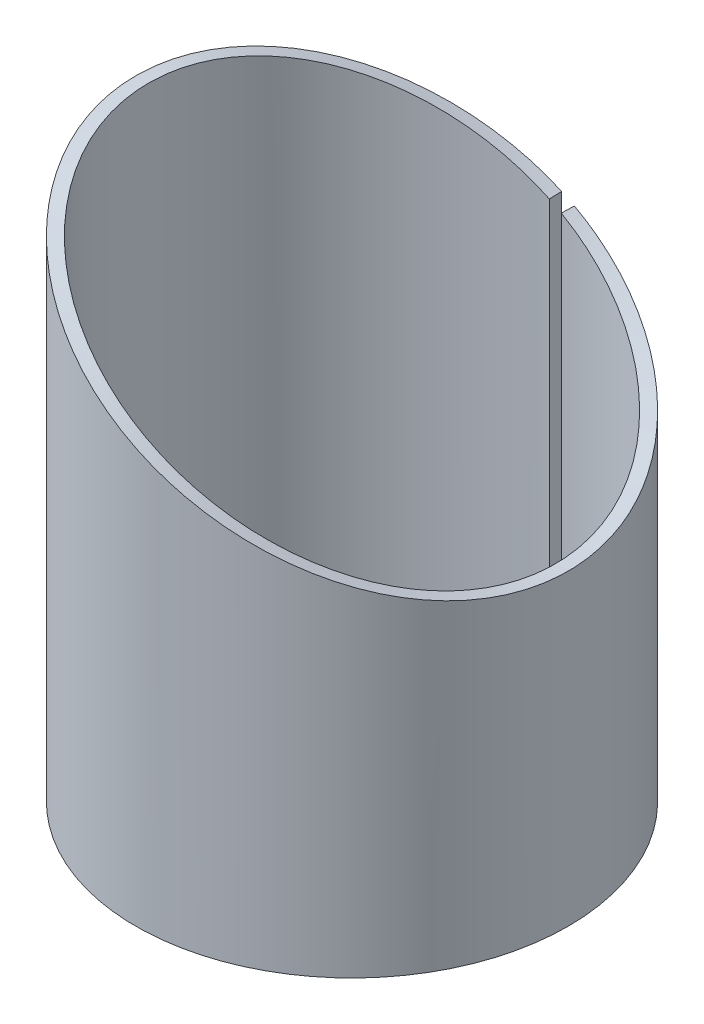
ISO-10303-21;
HEADER;
FILE_DESCRIPTION(('STEP AP214'),'2;1');
FILE_NAME('part.step','',(''),(''),'','','');
FILE_SCHEMA(('AUTOMOTIVE_DESIGN { 1 0 10303 214 1 1 1 1 }'));
ENDSEC;
DATA;
#1=APPLICATION_CONTEXT('core data for automotive mechanical design processes');
#2=APPLICATION_PROTOCOL_DEFINITION('international standard','automotive_design',2000,#1);
#3=PRODUCT_CONTEXT('',#1,'mechanical');
#4=PRODUCT('Part','Part','',(#3));
#5=PRODUCT_RELATED_PRODUCT_CATEGORY('part','',(#4));
#6=PRODUCT_DEFINITION_FORMATION('','',#4);
#7=PRODUCT_DEFINITION_CONTEXT('part definition',#1,'design');
#8=PRODUCT_DEFINITION('design','',#6,#7);
#9=PRODUCT_DEFINITION_SHAPE('','',#8);
#10=(LENGTH_UNIT() NAMED_UNIT(*) SI_UNIT(.MILLI.,.METRE.));
#11=(NAMED_UNIT(*) PLANE_ANGLE_UNIT() SI_UNIT($,.RADIAN.));
#12=(NAMED_UNIT(*) SI_UNIT($,.STERADIAN.) SOLID_ANGLE_UNIT());
#13=UNCERTAINTY_MEASURE_WITH_UNIT(LENGTH_MEASURE(1.E-05),#10,'distance_accuracy_value','');
#14=(GEOMETRIC_REPRESENTATION_CONTEXT(3) GLOBAL_UNCERTAINTY_ASSIGNED_CONTEXT((#13)) GLOBAL_UNIT_ASSIGNED_CONTEXT((#10,
#11,#12)) REPRESENTATION_CONTEXT('',''));
#15=CARTESIAN_POINT('',(0.,0.,0.));
#16=DIRECTION('',(0.,0.,1.));
#17=DIRECTION('',(1.,0.,0.));
#18=AXIS2_PLACEMENT_3D('',#15,#16,#17);
#19=CARTESIAN_POINT('',(-43.4377584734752,-32.7102460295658,-16.9698156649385));
#20=CARTESIAN_POINT('',(-44.0672901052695,-32.3998788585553,-16.9512670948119));
#21=CARTESIAN_POINT('',(-44.633374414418,-32.1211131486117,-16.8998626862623));
#22=CARTESIAN_POINT('',(-45.6364569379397,-31.6265191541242,-16.7689444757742));
#23=CARTESIAN_POINT('',(-46.0734881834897,-31.4107351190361,-16.6894479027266));
#24=CARTESIAN_POINT('',(-46.5405221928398,-31.1803962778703,-16.5907760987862));
#25=CARTESIAN_POINT('',(-46.630176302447,-31.1361994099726,-16.5710348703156));
#26=CARTESIAN_POINT('',(-46.8099582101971,-31.0475701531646,-16.5299490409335));
#27=CARTESIAN_POINT('',(-46.8990439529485,-31.0036563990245,-16.5088195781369));
#28=CARTESIAN_POINT('',(-47.1638725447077,-30.8731177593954,-16.4437725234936));
#29=CARTESIAN_POINT('',(-47.3371858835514,-30.7876954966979,-16.3981967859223));
#30=CARTESIAN_POINT('',(-47.847337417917,-30.5362391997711,-16.2556261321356));
#31=CARTESIAN_POINT('',(-48.1743750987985,-30.3750156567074,-16.1527968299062));
#32=CARTESIAN_POINT('',(-48.8022584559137,-30.0653965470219,-15.9355777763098));
#33=CARTESIAN_POINT('',(-49.1031066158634,-29.9170009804,-15.8211886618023));
#34=CARTESIAN_POINT('',(-49.534956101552,-29.7040286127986,-15.6437159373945));
#35=CARTESIAN_POINT('',(-49.6757224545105,-29.6346194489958,-15.5835716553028));
#36=CARTESIAN_POINT('',(-49.9543621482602,-29.4972382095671,-15.4601143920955));
#37=CARTESIAN_POINT('',(-50.0917868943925,-29.4294869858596,-15.3969814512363));
#38=CARTESIAN_POINT('',(-50.7693843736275,-29.0954278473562,-15.0748315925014));
#39=CARTESIAN_POINT('',(-51.2808979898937,-28.8432108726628,-14.7964060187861));
#40=CARTESIAN_POINT('',(-52.2428444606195,-28.3688375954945,-14.2111569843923));
#41=CARTESIAN_POINT('',(-52.6925885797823,-28.1471378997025,-13.9051960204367));
#42=CARTESIAN_POINT('',(-53.5492137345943,-27.7248095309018,-13.2630390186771));
#43=CARTESIAN_POINT('',(-53.953853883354,-27.5252609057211,-12.9280575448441));
#44=CARTESIAN_POINT('',(-54.7160446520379,-27.149394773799,-12.2376878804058));
#45=CARTESIAN_POINT('',(-55.0730253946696,-26.9734407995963,-11.8830805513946));
#46=CARTESIAN_POINT('',(-55.7482552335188,-26.6405727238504,-11.1518374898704));
#47=CARTESIAN_POINT('',(-56.0655616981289,-26.4841101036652,-10.775940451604));
#48=CARTESIAN_POINT('',(-56.6596315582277,-26.1911276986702,-10.0085118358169));
#49=CARTESIAN_POINT('',(-56.9359494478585,-26.0548577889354,-9.61770165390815));
#50=CARTESIAN_POINT('',(-57.4510101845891,-25.8009430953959,-8.82128451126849));
#51=CARTESIAN_POINT('',(-57.6899239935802,-25.6831687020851,-8.41525419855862));
#52=CARTESIAN_POINT('',(-58.130382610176,-25.4659858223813,-7.59124908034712));
#53=CARTESIAN_POINT('',(-58.3319284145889,-25.3665773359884,-7.17327521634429));
#54=CARTESIAN_POINT('',(-58.697861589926,-25.1861262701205,-6.3289410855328));
#55=CARTESIAN_POINT('',(-58.8626760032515,-25.1049395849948,-5.90173373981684));
#56=CARTESIAN_POINT('',(-59.5987210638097,-24.7426429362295,-3.73871923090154));
#57=CARTESIAN_POINT('',(-59.8995106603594,-24.5939306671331,-1.93128972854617));
#58=CARTESIAN_POINT('',(-59.9180662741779,-24.5844466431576,0.306892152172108));
#59=CARTESIAN_POINT('',(-59.9041415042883,-24.5913710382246,0.753608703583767));
#60=CARTESIAN_POINT('',(-59.84062541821,-24.622923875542,1.64899007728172));
#61=CARTESIAN_POINT('',(-59.7910066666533,-24.6475444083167,2.09680711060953));
#62=CARTESIAN_POINT('',(-59.5880540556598,-24.7479383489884,3.43628066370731));
#63=CARTESIAN_POINT('',(-59.3804979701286,-24.8502440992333,4.32398357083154));
#64=CARTESIAN_POINT('',(-58.9609022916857,-25.0567674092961,5.62960691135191));
#65=CARTESIAN_POINT('',(-58.8030244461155,-25.1344526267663,6.06048587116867));
#66=CARTESIAN_POINT('',(-58.451647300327,-25.3075112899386,6.91052869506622));
#67=CARTESIAN_POINT('',(-58.2584153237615,-25.4028037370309,7.32931916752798));
#68=CARTESIAN_POINT('',(-57.8336552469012,-25.6122911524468,8.15804542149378));
#69=CARTESIAN_POINT('',(-57.6023898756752,-25.726345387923,8.56723652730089));
#70=CARTESIAN_POINT('',(-57.10194961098,-25.9730749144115,9.37148042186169));
#71=CARTESIAN_POINT('',(-56.8331905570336,-26.1055297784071,9.76598331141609));
#72=CARTESIAN_POINT('',(-55.9675313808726,-26.53235198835,10.9261584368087));
#73=CARTESIAN_POINT('',(-55.307654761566,-26.8578174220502,11.6726474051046));
#74=CARTESIAN_POINT('',(-54.1927585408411,-27.4073915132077,12.7204447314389));
#75=CARTESIAN_POINT('',(-53.7978107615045,-27.6021935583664,13.0601646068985));
#76=CARTESIAN_POINT('',(-52.9573285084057,-28.0166654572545,13.7155696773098));
#77=CARTESIAN_POINT('',(-52.5122757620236,-28.236072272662,14.030789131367));
#78=CARTESIAN_POINT('',(-51.8076190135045,-28.583438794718,14.4785242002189));
#79=CARTESIAN_POINT('',(-51.5658943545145,-28.7026259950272,14.6240554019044));
#80=CARTESIAN_POINT('',(-51.0644902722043,-28.9498919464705,14.9085195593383));
#81=CARTESIAN_POINT('',(-50.8053993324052,-29.0776647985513,15.047072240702));
#82=CARTESIAN_POINT('',(-50.2703354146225,-29.3414902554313,15.3149427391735));
#83=CARTESIAN_POINT('',(-49.9943617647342,-29.4775428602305,15.4442602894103));
#84=CARTESIAN_POINT('',(-49.5677772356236,-29.687831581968,15.6298285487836));
#85=CARTESIAN_POINT('',(-49.4234796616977,-29.758962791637,15.6902825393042));
#86=CARTESIAN_POINT('',(-49.1307016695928,-29.9032951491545,15.8081308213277));
#87=CARTESIAN_POINT('',(-48.9827061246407,-29.9762565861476,15.865361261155));
#88=CARTESIAN_POINT('',(-48.2202809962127,-30.3522462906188,16.1475255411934));
#89=CARTESIAN_POINT('',(-47.5457361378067,-30.6849708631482,16.3575197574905));
#90=CARTESIAN_POINT('',(-46.6209904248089,-31.1407925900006,16.5739109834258));
#91=CARTESIAN_POINT('',(-46.4319840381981,-31.2339527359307,16.614865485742));
#92=CARTESIAN_POINT('',(-46.1906998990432,-31.3528976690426,16.6626959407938));
#93=CARTESIAN_POINT('',(-46.1421918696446,-31.3768113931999,16.6720938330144));
#94=CARTESIAN_POINT('',(-46.0446749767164,-31.4248883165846,16.6905415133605));
#95=CARTESIAN_POINT('',(-45.9957861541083,-31.4489922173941,16.6995754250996));
#96=CARTESIAN_POINT('',(-45.8421112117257,-31.5247933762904,16.7272297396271));
#97=CARTESIAN_POINT('',(-45.7323729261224,-31.578953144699,16.746009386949));
#98=CARTESIAN_POINT('',(-45.1469887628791,-31.8678802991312,16.8395027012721));
#99=CARTESIAN_POINT('',(-44.5608347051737,-32.1570326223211,16.9141436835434));
#100=CARTESIAN_POINT('',(-43.6800219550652,-32.5909862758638,16.9618634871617));
#101=CARTESIAN_POINT('',(-43.4964851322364,-32.6814026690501,16.9690573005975));
#102=CARTESIAN_POINT('',(-43.2102234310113,-32.8224657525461,16.9752618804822));
#103=CARTESIAN_POINT('',(-43.1129774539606,-32.8703931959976,16.9765648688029));
#104=CARTESIAN_POINT('',(-42.9148609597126,-32.9680609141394,16.9774536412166));
#105=CARTESIAN_POINT('',(-42.8146225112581,-33.0174845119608,16.9770123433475));
#106=CARTESIAN_POINT('',(-42.3281743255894,-33.2572381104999,16.9706959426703));
#107=CARTESIAN_POINT('',(-41.9680632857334,-33.4345926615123,16.9527066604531));
#108=CARTESIAN_POINT('',(-40.9763223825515,-33.9233113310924,16.8765258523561));
#109=CARTESIAN_POINT('',(-40.4335223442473,-34.1913304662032,16.7970400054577));
#110=CARTESIAN_POINT('',(-39.9009378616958,-34.454112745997,16.7037139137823));
#111=CARTESIAN_POINT('',(-39.8035372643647,-34.5021361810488,16.6856578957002));
#112=CARTESIAN_POINT('',(-39.6083928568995,-34.5983464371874,16.6478180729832));
#113=CARTESIAN_POINT('',(-39.511821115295,-34.6459532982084,16.6282031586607));
#114=CARTESIAN_POINT('',(-39.2251247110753,-34.787279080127,16.5674128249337));
#115=CARTESIAN_POINT('',(-39.0380201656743,-34.87950319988,16.5242926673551));
#116=CARTESIAN_POINT('',(-38.4888762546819,-35.1501963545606,16.3882379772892));
#117=CARTESIAN_POINT('',(-38.13902391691,-35.3226861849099,16.2886239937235));
#118=CARTESIAN_POINT('',(-37.4718277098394,-35.6517213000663,16.0770247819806));
#119=CARTESIAN_POINT('',(-37.154479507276,-35.8082665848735,15.9650404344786));
#120=CARTESIAN_POINT('',(-36.5518021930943,-36.1054126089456,15.7336707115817));
#121=CARTESIAN_POINT('',(-36.2600542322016,-36.2492170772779,15.6118431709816));
#122=CARTESIAN_POINT('',(-35.4090243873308,-36.6687530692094,15.2292401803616));
#123=CARTESIAN_POINT('',(-34.8761470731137,-36.9315489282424,14.9522068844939));
#124=CARTESIAN_POINT('',(-34.1281666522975,-37.3004005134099,14.5154776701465));
#125=CARTESIAN_POINT('',(-33.887996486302,-37.4187977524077,14.3667947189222));
#126=CARTESIAN_POINT('',(-33.419332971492,-37.6498303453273,14.0606741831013));
#127=CARTESIAN_POINT('',(-33.1912897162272,-37.7622491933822,13.9034535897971));
#128=CARTESIAN_POINT('',(-32.5260986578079,-38.0902133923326,13.4209578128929));
#129=CARTESIAN_POINT('',(-32.1079232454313,-38.2964663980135,13.0848703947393));
#130=CARTESIAN_POINT('',(-31.3216554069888,-38.6841928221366,12.3921472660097));
#131=CARTESIAN_POINT('',(-30.952942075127,-38.8659145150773,12.0352075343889));
#132=CARTESIAN_POINT('',(-30.2556496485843,-39.2096949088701,11.2980600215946));
#133=CARTESIAN_POINT('',(-29.9283077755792,-39.3711291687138,10.9189001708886));
#134=CARTESIAN_POINT('',(-29.3160168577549,-39.6730858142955,10.1447692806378));
#135=CARTESIAN_POINT('',(-29.0313706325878,-39.8134030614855,9.75038338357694));
#136=CARTESIAN_POINT('',(-28.4998807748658,-40.0754114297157,8.94456742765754));
#137=CARTESIAN_POINT('',(-28.2535618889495,-40.1968599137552,8.53371104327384));
#138=CARTESIAN_POINT('',(-27.7997787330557,-40.4206454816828,7.70009239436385));
#139=CARTESIAN_POINT('',(-27.5925511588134,-40.5228778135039,7.27788224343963));
#140=CARTESIAN_POINT('',(-27.2154838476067,-40.7087091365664,6.42285279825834));
#141=CARTESIAN_POINT('',(-27.045184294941,-40.7925271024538,5.98885591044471));
#142=CARTESIAN_POINT('',(-26.589738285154,-41.0166879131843,4.67220947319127));
#143=CARTESIAN_POINT('',(-26.3601769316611,-41.1297376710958,3.77493084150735));
#144=CARTESIAN_POINT('',(-26.0499172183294,-41.2830556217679,1.9665020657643));
#145=CARTESIAN_POINT('',(-25.969210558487,-41.3233146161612,1.05631896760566));
#146=CARTESIAN_POINT('',(-25.9532588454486,-41.3310892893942,-0.757760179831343));
#147=CARTESIAN_POINT('',(-26.0180940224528,-41.2986873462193,-1.67023779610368));
#148=CARTESIAN_POINT('',(-26.2962618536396,-41.1613049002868,-3.48214440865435));
#149=CARTESIAN_POINT('',(-26.5096047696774,-41.0563243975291,-4.38155187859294));
#150=CARTESIAN_POINT('',(-27.0836618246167,-40.7737848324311,-6.14246289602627));
#151=CARTESIAN_POINT('',(-27.4429202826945,-40.5965793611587,-7.00207337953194));
#152=CARTESIAN_POINT('',(-28.0980944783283,-40.2734939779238,-8.26030361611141));
#153=CARTESIAN_POINT('',(-28.3357153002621,-40.1563513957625,-8.67384333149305));
#154=CARTESIAN_POINT('',(-28.849333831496,-39.903171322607,-9.4853315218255));
#155=CARTESIAN_POINT('',(-29.1251348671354,-39.7671943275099,-9.88317831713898));
#156=CARTESIAN_POINT('',(-29.7194872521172,-39.4740727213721,-10.6650405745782));
#157=CARTESIAN_POINT('',(-30.0375721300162,-39.3172094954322,-11.0482523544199));
#158=CARTESIAN_POINT('',(-30.7157282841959,-38.9828781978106,-11.7940945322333));
#159=CARTESIAN_POINT('',(-31.0746945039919,-38.8059597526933,-12.155793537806));
#160=CARTESIAN_POINT('',(-31.8416965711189,-38.4277224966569,-12.8597439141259));
#161=CARTESIAN_POINT('',(-32.2495086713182,-38.2265943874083,-13.2015242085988));
#162=CARTESIAN_POINT('',(-32.8979646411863,-37.9068880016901,-13.6930914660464));
#163=CARTESIAN_POINT('',(-33.1202318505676,-37.7973168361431,-13.853425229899));
#164=CARTESIAN_POINT('',(-33.5769414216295,-37.5721697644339,-14.1660270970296));
#165=CARTESIAN_POINT('',(-33.8115590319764,-37.456494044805,-14.3184610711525));
#166=CARTESIAN_POINT('',(-34.540058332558,-37.0972735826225,-14.7657738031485));
#167=CARTESIAN_POINT('',(-35.0566424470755,-36.8425739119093,-15.0492904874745));
#168=CARTESIAN_POINT('',(-35.8778572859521,-36.4376953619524,-15.442621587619));
#169=CARTESIAN_POINT('',(-36.1582842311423,-36.2994283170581,-15.5679815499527));
#170=CARTESIAN_POINT('',(-36.7388361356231,-36.0130867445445,-15.8081207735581));
#171=CARTESIAN_POINT('',(-37.0420684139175,-35.8635081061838,-15.924121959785));
#172=CARTESIAN_POINT('',(-37.6747204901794,-35.5515351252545,-16.1442637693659));
#173=CARTESIAN_POINT('',(-38.0041427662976,-35.3891407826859,-16.24840373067));
#174=CARTESIAN_POINT('',(-38.517856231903,-35.1359374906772,-16.3927039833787));
#175=CARTESIAN_POINT('',(-38.6923543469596,-35.0499344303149,-16.438816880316));
#176=CARTESIAN_POINT('',(-38.9589540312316,-34.9185268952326,-16.5046095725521));
#177=CARTESIAN_POINT('',(-39.0486291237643,-34.874323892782,-16.5259775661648));
#178=CARTESIAN_POINT('',(-39.2295872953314,-34.7851169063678,-16.5675202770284));
#179=CARTESIAN_POINT('',(-39.3198740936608,-34.7406088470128,-16.5874870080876));
#180=CARTESIAN_POINT('',(-39.7882175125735,-34.5096353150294,-16.6868732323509));
#181=CARTESIAN_POINT('',(-40.2269928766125,-34.2929868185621,-16.7670745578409));
#182=CARTESIAN_POINT('',(-41.2350204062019,-33.795950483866,-16.8992225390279));
#183=CARTESIAN_POINT('',(-41.8043069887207,-33.5156078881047,-16.9511515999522));
#184=CARTESIAN_POINT('',(-42.4377584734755,-33.203305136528,-16.9698156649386));
#185=CARTESIAN_POINT('',(-43.4083071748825,-32.7102460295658,-15.970249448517));
#186=CARTESIAN_POINT('',(-44.0007556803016,-32.3998799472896,-15.9527934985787));
#187=CARTESIAN_POINT('',(-44.5334982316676,-32.1211131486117,-15.9044168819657));
#188=CARTESIAN_POINT('',(-45.4774965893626,-31.6265191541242,-15.7812100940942));
#189=CARTESIAN_POINT('',(-45.8887855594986,-31.4107351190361,-15.7063960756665));
#190=CARTESIAN_POINT('',(-46.3283100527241,-31.1803962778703,-15.613536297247));
#191=CARTESIAN_POINT('',(-46.412683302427,-31.1361994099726,-15.5949578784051));
#192=CARTESIAN_POINT('',(-46.5818755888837,-31.0475701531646,-15.556292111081));
#193=CARTESIAN_POINT('',(-46.6657139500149,-31.0036563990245,-15.5364072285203));
#194=CARTESIAN_POINT('',(-46.9149434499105,-30.8731177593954,-15.4751916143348));
#195=CARTESIAN_POINT('',(-47.0780481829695,-30.7876954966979,-15.4323004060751));
#196=CARTESIAN_POINT('',(-47.5581504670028,-30.5362391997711,-15.2981275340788));
#197=CARTESIAN_POINT('',(-47.865924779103,-30.3750156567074,-15.2013551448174));
#198=CARTESIAN_POINT('',(-48.4568241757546,-30.0653965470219,-14.996930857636));
#199=CARTESIAN_POINT('',(-48.7399515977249,-29.9170009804,-14.8892795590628));
#200=CARTESIAN_POINT('',(-49.1463640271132,-29.7040286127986,-14.7222604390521));
#201=CARTESIAN_POINT('',(-49.2788388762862,-29.6346194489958,-14.6656588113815));
#202=CARTESIAN_POINT('',(-49.5410659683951,-29.4972382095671,-14.5494735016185));
#203=CARTESIAN_POINT('',(-49.6703960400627,-29.4294869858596,-14.4900592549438));
#204=CARTESIAN_POINT('',(-50.3080812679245,-29.0954278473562,-14.1868848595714));
#205=CARTESIAN_POINT('',(-50.7894654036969,-28.8432108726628,-13.9248592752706));
#206=CARTESIAN_POINT('',(-51.6947507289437,-28.3688375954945,-13.3740829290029));
#207=CARTESIAN_POINT('',(-52.1180037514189,-28.1471378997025,-13.0861438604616));
#208=CARTESIAN_POINT('',(-52.9241714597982,-27.7248095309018,-12.4818115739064));
#209=CARTESIAN_POINT('',(-53.3049772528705,-27.5252609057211,-12.1665613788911));
#210=CARTESIAN_POINT('',(-54.0222730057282,-27.149394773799,-11.5168562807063));
#211=CARTESIAN_POINT('',(-54.3582266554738,-26.9734407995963,-11.1831362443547));
#212=CARTESIAN_POINT('',(-54.9936837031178,-26.6405727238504,-10.494965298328));
#213=CARTESIAN_POINT('',(-55.2922999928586,-26.4841101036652,-10.1412095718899));
#214=CARTESIAN_POINT('',(-55.8513775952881,-26.1911276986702,-9.41898449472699));
#215=CARTESIAN_POINT('',(-56.1114196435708,-26.0548577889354,-9.05119404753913));
#216=CARTESIAN_POINT('',(-56.5961419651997,-25.8009430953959,-8.30168794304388));
#217=CARTESIAN_POINT('',(-56.8209831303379,-25.6831687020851,-7.9195738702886));
#218=CARTESIAN_POINT('',(-57.2354975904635,-25.4659858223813,-7.14410479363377));
#219=CARTESIAN_POINT('',(-57.4251718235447,-25.3665773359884,-6.75075067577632));
#220=CARTESIAN_POINT('',(-57.7695505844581,-25.1861262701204,-5.95615001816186));
#221=CARTESIAN_POINT('',(-57.9246570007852,-25.1049395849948,-5.55410629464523));
#222=CARTESIAN_POINT('',(-58.6173470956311,-24.7426429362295,-3.51849895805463));
#223=CARTESIAN_POINT('',(-58.9004194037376,-24.5939306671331,-1.81753174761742));
#224=CARTESIAN_POINT('',(-58.9178820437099,-24.5844466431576,0.288815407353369));
#225=CARTESIAN_POINT('',(-58.904777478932,-24.5913710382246,0.709219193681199));
#226=CARTESIAN_POINT('',(-58.8450026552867,-24.622923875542,1.55186027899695));
#227=CARTESIAN_POINT('',(-58.7983065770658,-24.6475444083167,1.97329972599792));
#228=CARTESIAN_POINT('',(-58.6073084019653,-24.7479383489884,3.23387480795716));
#229=CARTESIAN_POINT('',(-58.4119779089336,-24.8502440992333,4.06928970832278));
#230=CARTESIAN_POINT('',(-58.0170975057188,-25.0567674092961,5.29800844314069));
#231=CARTESIAN_POINT('',(-57.8685190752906,-25.1344526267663,5.70350751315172));
#232=CARTESIAN_POINT('',(-57.5378389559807,-25.3075112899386,6.50348060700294));
#233=CARTESIAN_POINT('',(-57.3559888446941,-25.4028037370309,6.89760323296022));
#234=CARTESIAN_POINT('',(-56.9562482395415,-25.6122911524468,7.67751535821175));
#235=CARTESIAN_POINT('',(-56.7386049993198,-25.7263453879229,8.06260404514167));
#236=CARTESIAN_POINT('',(-56.2676419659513,-25.9730749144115,8.81947588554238));
#237=CARTESIAN_POINT('',(-56.0147135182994,-26.1055297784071,9.1907415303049));
#238=CARTESIAN_POINT('',(-55.2000439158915,-26.53235198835,10.2825793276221));
#239=CARTESIAN_POINT('',(-54.5790357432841,-26.8578174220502,10.9850981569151));
#240=CARTESIAN_POINT('',(-53.529809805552,-27.4073915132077,11.9711774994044));
#241=CARTESIAN_POINT('',(-53.1581254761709,-27.6021935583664,12.290886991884));
#242=CARTESIAN_POINT('',(-52.3671498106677,-28.0166654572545,12.9076870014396));
#243=CARTESIAN_POINT('',(-51.9483118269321,-28.236072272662,13.2043392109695));
#244=CARTESIAN_POINT('',(-51.2851611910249,-28.583438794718,13.6257015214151));
#245=CARTESIAN_POINT('',(-51.0576747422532,-28.7026259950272,13.7626605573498));
#246=CARTESIAN_POINT('',(-50.5858046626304,-28.9498919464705,14.0303690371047));
#247=CARTESIAN_POINT('',(-50.3419748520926,-29.0776647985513,14.1607606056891));
#248=CARTESIAN_POINT('',(-49.8384275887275,-29.3414902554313,14.4128528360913));
#249=CARTESIAN_POINT('',(-49.5787095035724,-29.4775428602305,14.5345532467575));
#250=CARTESIAN_POINT('',(-49.1772519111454,-29.687831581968,14.7091910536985));
#251=CARTESIAN_POINT('',(-49.0414538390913,-29.758962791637,14.7660841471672));
#252=CARTESIAN_POINT('',(-48.7659212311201,-29.9032951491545,14.8769908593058));
#253=CARTESIAN_POINT('',(-48.6266430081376,-29.9762565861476,14.9308502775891));
#254=CARTESIAN_POINT('',(-47.9091266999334,-30.3522462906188,15.1963943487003));
#255=CARTESIAN_POINT('',(-47.2743142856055,-30.6849708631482,15.3940193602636));
#256=CARTESIAN_POINT('',(-46.4040384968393,-31.1407925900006,15.5976645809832));
#257=CARTESIAN_POINT('',(-46.2261650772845,-31.2339527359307,15.6362067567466));
#258=CARTESIAN_POINT('',(-45.9990932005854,-31.3528976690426,15.6812198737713));
#259=CARTESIAN_POINT('',(-45.9534424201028,-31.3768113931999,15.690064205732));
#260=CARTESIAN_POINT('',(-45.8616695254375,-31.4248883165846,15.7074252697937));
#261=CARTESIAN_POINT('',(-45.8156603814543,-31.4489922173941,15.7159270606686));
#262=CARTESIAN_POINT('',(-45.6710372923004,-31.5247933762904,15.7419524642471));
#263=CARTESIAN_POINT('',(-45.5677628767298,-31.578953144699,15.7596259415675));
#264=CARTESIAN_POINT('',(-45.0168593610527,-31.8678802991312,15.8476122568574));
#265=CARTESIAN_POINT('',(-44.4652312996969,-32.1570326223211,15.9178566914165));
#266=CARTESIAN_POINT('',(-43.6363007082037,-32.5909862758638,15.9627656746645));
#267=CARTESIAN_POINT('',(-43.4635746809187,-32.6814026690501,15.9695357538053));
#268=CARTESIAN_POINT('',(-43.1941745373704,-32.8224657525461,15.9753748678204));
#269=CARTESIAN_POINT('',(-43.1026566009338,-32.8703931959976,15.9766011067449));
#270=CARTESIAN_POINT('',(-42.9162096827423,-32.9680609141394,15.9774375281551));
#271=CARTESIAN_POINT('',(-42.8218755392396,-33.0174845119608,15.9770222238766));
#272=CARTESIAN_POINT('',(-42.3640804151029,-33.2572381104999,15.9710778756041));
#273=CARTESIAN_POINT('',(-42.0251808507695,-33.4345926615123,15.9541482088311));
#274=CARTESIAN_POINT('',(-41.0918560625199,-33.9233113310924,15.8824546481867));
#275=CARTESIAN_POINT('',(-40.5810283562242,-34.1913304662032,15.80765072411));
#276=CARTESIAN_POINT('',(-40.0798144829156,-34.454112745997,15.7198217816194));
#277=CARTESIAN_POINT('',(-39.9881510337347,-34.5021361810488,15.7028293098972));
#278=CARTESIAN_POINT('',(-39.8045011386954,-34.5983464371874,15.6672183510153));
#279=CARTESIAN_POINT('',(-39.7136177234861,-34.6459532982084,15.6487588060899));
#280=CARTESIAN_POINT('',(-39.4438084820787,-34.787279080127,15.5915491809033));
#281=CARTESIAN_POINT('',(-39.267724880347,-34.87950319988,15.5509689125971));
#282=CARTESIAN_POINT('',(-38.7509269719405,-35.1501963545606,15.4229281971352));
#283=CARTESIAN_POINT('',(-38.4216818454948,-35.3226861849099,15.3291817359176));
#284=CARTESIAN_POINT('',(-37.7937852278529,-35.6517213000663,15.1300462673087));
#285=CARTESIAN_POINT('',(-37.4951296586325,-35.8082665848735,15.0246580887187));
#286=CARTESIAN_POINT('',(-36.9279516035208,-36.1054126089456,14.8069166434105));
#287=CARTESIAN_POINT('',(-36.6533883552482,-36.2492170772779,14.6922650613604));
#288=CARTESIAN_POINT('',(-35.8524863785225,-36.6687530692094,14.3321983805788));
#289=CARTESIAN_POINT('',(-35.350996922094,-36.9315489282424,14.0714830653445));
#290=CARTESIAN_POINT('',(-34.6470744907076,-37.3004005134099,13.6604783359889));
#291=CARTESIAN_POINT('',(-34.4210509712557,-37.4187977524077,13.5205531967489));
#292=CARTESIAN_POINT('',(-33.979992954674,-37.6498303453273,13.2324639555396));
#293=CARTESIAN_POINT('',(-33.765382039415,-37.7622491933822,13.0845040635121));
#294=CARTESIAN_POINT('',(-33.1393724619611,-38.0902133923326,12.6304285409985));
#295=CARTESIAN_POINT('',(-32.7458286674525,-38.2964663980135,12.3141375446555));
#296=CARTESIAN_POINT('',(-32.0058740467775,-38.6841928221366,11.6622176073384));
#297=CARTESIAN_POINT('',(-31.6588788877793,-38.8659145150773,11.3263025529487));
#298=CARTESIAN_POINT('',(-31.0026587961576,-39.2096949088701,10.6325749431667));
#299=CARTESIAN_POINT('',(-30.69459820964,-39.3711291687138,10.2757485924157));
#300=CARTESIAN_POINT('',(-30.1183728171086,-39.6730858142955,9.54721602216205));
#301=CARTESIAN_POINT('',(-29.8504929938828,-39.8134030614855,9.17606047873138));
#302=CARTESIAN_POINT('',(-29.3503092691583,-40.0754114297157,8.41770917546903));
#303=CARTESIAN_POINT('',(-29.1184992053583,-40.1968599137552,8.03105329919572));
#304=CARTESIAN_POINT('',(-28.6914450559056,-40.4206454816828,7.24653695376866));
#305=CARTESIAN_POINT('',(-28.4964237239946,-40.5228778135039,6.8491960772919));
#306=CARTESIAN_POINT('',(-28.1415666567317,-40.7087091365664,6.04453008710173));
#307=CARTESIAN_POINT('',(-27.9812981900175,-40.7925271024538,5.63609674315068));
#308=CARTESIAN_POINT('',(-27.5526791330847,-41.0166879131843,4.39700420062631));
#309=CARTESIAN_POINT('',(-27.3366395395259,-41.1297376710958,3.55257761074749));
#310=CARTESIAN_POINT('',(-27.0446549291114,-41.2830556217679,1.85066998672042));
#311=CARTESIAN_POINT('',(-26.9687021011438,-41.3233146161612,0.994099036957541));
#312=CARTESIAN_POINT('',(-26.9536899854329,-41.3310892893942,-0.71312613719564));
#313=CARTESIAN_POINT('',(-27.0147062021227,-41.2986873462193,-1.57185645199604));
#314=CARTESIAN_POINT('',(-27.2764892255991,-41.1613049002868,-3.27703705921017));
#315=CARTESIAN_POINT('',(-27.4772656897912,-41.0563243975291,-4.12346709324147));
#316=CARTESIAN_POINT('',(-28.017509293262,-40.7737848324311,-5.78065587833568));
#317=CARTESIAN_POINT('',(-28.3556064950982,-40.5965793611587,-6.58963307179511));
#318=CARTESIAN_POINT('',(-28.9721892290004,-40.2734939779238,-7.77375027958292));
#319=CARTESIAN_POINT('',(-29.195813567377,-40.1563513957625,-8.16293143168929));
#320=CARTESIAN_POINT('',(-29.6791786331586,-39.903171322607,-8.92662086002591));
#321=CARTESIAN_POINT('',(-29.9387342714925,-39.7671943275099,-9.30103344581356));
#322=CARTESIAN_POINT('',(-30.4980777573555,-39.4740727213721,-10.0368419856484));
#323=CARTESIAN_POINT('',(-30.7974266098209,-39.3172094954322,-10.3974815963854));
#324=CARTESIAN_POINT('',(-31.4356376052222,-38.9828781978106,-11.0993917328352));
#325=CARTESIAN_POINT('',(-31.7734597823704,-38.8059597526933,-11.4397857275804));
#326=CARTESIAN_POINT('',(-32.4952834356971,-38.4277224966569,-12.1022715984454));
#327=CARTESIAN_POINT('',(-32.8790743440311,-38.2265943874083,-12.4239201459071));
#328=CARTESIAN_POINT('',(-33.4893345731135,-37.9068880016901,-12.8865328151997));
#329=CARTESIAN_POINT('',(-33.6985096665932,-37.7973168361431,-13.0374225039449));
#330=CARTESIAN_POINT('',(-34.1283178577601,-37.5721697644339,-13.3316113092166));
#331=CARTESIAN_POINT('',(-34.3491158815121,-37.456494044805,-13.4750665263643));
#332=CARTESIAN_POINT('',(-35.0347046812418,-37.0972735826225,-13.8960313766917));
#333=CARTESIAN_POINT('',(-35.5208606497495,-36.8425739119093,-14.1628481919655));
#334=CARTESIAN_POINT('',(-36.2937038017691,-36.4376953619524,-14.5330110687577));
#335=CARTESIAN_POINT('',(-36.5576128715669,-36.2994283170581,-14.6509870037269));
#336=CARTESIAN_POINT('',(-37.1039687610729,-36.0130867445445,-14.8769814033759));
#337=CARTESIAN_POINT('',(-37.3893398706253,-35.8635081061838,-14.9861498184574));
#338=CARTESIAN_POINT('',(-37.9847270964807,-35.5515351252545,-15.1933247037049));
#339=CARTESIAN_POINT('',(-38.2947455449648,-35.3891407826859,-15.2913305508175));
#340=CARTESIAN_POINT('',(-38.7781999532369,-35.1359374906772,-15.4271311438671));
#341=CARTESIAN_POINT('',(-38.9424196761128,-35.0499344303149,-15.470527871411));
#342=CARTESIAN_POINT('',(-39.1933159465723,-34.9185268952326,-15.5324452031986));
#343=CARTESIAN_POINT('',(-39.277708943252,-34.874323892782,-15.5525545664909));
#344=CARTESIAN_POINT('',(-39.4480082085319,-34.7851169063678,-15.5916503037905));
#345=CARTESIAN_POINT('',(-39.5329768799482,-34.7406088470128,-15.610440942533));
#346=CARTESIAN_POINT('',(-39.9737336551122,-34.5096353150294,-15.7039730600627));
#347=CARTESIAN_POINT('',(-40.3866640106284,-34.2929868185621,-15.7794503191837));
#348=CARTESIAN_POINT('',(-41.3353161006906,-33.795950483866,-15.9038144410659));
#349=CARTESIAN_POINT('',(-41.8710723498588,-33.5156067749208,-15.9526848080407));
#350=CARTESIAN_POINT('',(-42.4672097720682,-33.203305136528,-15.970249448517));
#351=B_SPLINE_SURFACE_WITH_KNOTS('',1,3,((#19,#20,#21,#22,#23,#24,#25,#26,#27,#28,#29,#30,#31,
#32,#33,#34,#35,#36,#37,#38,#39,#40,#41,#42,#43,#44,#45,#46,#47,#48,#49,#50,#51,#52,#53,#54,#55,
#56,#57,#58,#59,#60,#61,#62,#63,#64,#65,#66,#67,#68,#69,#70,#71,#72,#73,#74,#75,#76,#77,#78,#79,
#80,#81,#82,#83,#84,#85,#86,#87,#88,#89,#90,#91,#92,#93,#94,#95,#96,#97,#98,#99,#100,#101,#102,
#103,#104,#105,#106,#107,#108,#109,#110,#111,#112,#113,#114,#115,#116,#117,#118,#119,#120,#121,
#122,#123,#124,#125,#126,#127,#128,#129,#130,#131,#132,#133,#134,#135,#136,#137,#138,#139,#140,
#141,#142,#143,#144,#145,#146,#147,#148,#149,#150,#151,#152,#153,#154,#155,#156,#157,#158,#159,
#160,#161,#162,#163,#164,#165,#166,#167,#168,#169,#170,#171,#172,#173,#174,#175,#176,#177,#178,
#179,#180,#181,#182,#183,#184),(#185,#186,#187,#188,#189,#190,#191,#192,#193,#194,#195,#196,
#197,#198,#199,#200,#201,#202,#203,#204,#205,#206,#207,#208,#209,#210,#211,#212,#213,#214,#215,
#216,#217,#218,#219,#220,#221,#222,#223,#224,#225,#226,#227,#228,#229,#230,#231,#232,#233,#234,
#235,#236,#237,#238,#239,#240,#241,#242,#243,#244,#245,#246,#247,#248,#249,#250,#251,#252,#253,
#254,#255,#256,#257,#258,#259,#260,#261,#262,#263,#264,#265,#266,#267,#268,#269,#270,#271,#272,
#273,#274,#275,#276,#277,#278,#279,#280,#281,#282,#283,#284,#285,#286,#287,#288,#289,#290,#291,
#292,#293,#294,#295,#296,#297,#298,#299,#300,#301,#302,#303,#304,#305,#306,#307,#308,#309,#310,
#311,#312,#313,#314,#315,#316,#317,#318,#319,#320,#321,#322,#323,#324,#325,#326,#327,#328,#329,
#330,#331,#332,#333,#334,#335,#336,#337,#338,#339,#340,#341,#342,#343,#344,#345,#346,#347,#348,
#349,#350)),.UNSPECIFIED.,.F.,.F.,.F.,(2,2),(4,2,2,2,2,2,2,2,2,2,2,2,2,2,2,2,2,2,2,2,2,2,2,2,2,
2,2,2,2,2,2,2,2,2,2,2,2,2,2,2,2,2,2,2,2,2,2,2,2,2,2,2,2,2,2,2,2,2,2,2,2,2,2,2,2,2,2,2,2,2,2,2,2,
2,2,2,2,2,2,2,2,2,4),(0.,1.),(0.,0.0078125,0.015625,0.017578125,0.01953125,0.0234375,0.03125,
0.0390625,0.04296875,0.046875,0.0625,0.078125,0.09375,0.109375,0.125,0.140625,0.15625,0.171875,
0.1875,0.25,0.265625,0.28125,0.3125,0.328125,0.34375,0.359375,0.375,0.40625,0.421875,0.4375,
0.4453125,0.453125,0.4609375,0.46484375,0.46875,0.484375,0.48828125,0.4892578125,0.490234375,
0.4921875,0.5,0.501953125,0.5029296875,0.50390625,0.5078125,0.515625,0.517578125,0.51953125,
0.5234375,0.53125,0.5390625,0.546875,0.5625,0.5703125,0.578125,0.59375,0.609375,0.625,0.640625,
0.65625,0.671875,0.6875,0.71875,0.75,0.78125,0.8125,0.84375,0.859375,0.875,0.890625,0.90625,
0.921875,0.9296875,0.9375,0.953125,0.9609375,0.96875,0.9765625,0.98046875,0.982421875,0.984375,
0.9921875,1.),.UNSPECIFIED.);
#352=CARTESIAN_POINT('',(-42.4377584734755,-33.203305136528,-16.9698156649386));
#353=CARTESIAN_POINT('',(-42.4672097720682,-33.203305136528,-15.970249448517));
#354=B_SPLINE_CURVE_WITH_KNOTS('',1,(#352,#353),.UNSPECIFIED.,.F.,.F.,(2,2),(0.,1.),.UNSPECIFIED.);
#355=CARTESIAN_POINT('',(-42.4672097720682,-33.203305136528,-15.970249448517));
#356=VERTEX_POINT('',#355);
#357=CARTESIAN_POINT('',(-42.4377584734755,-33.203305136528,-16.9698156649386));
#358=VERTEX_POINT('',#357);
#359=EDGE_CURVE('E13',#356,#358,#354,.F.);
#360=CARTESIAN_POINT('',(-42.4672097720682,-33.203305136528,-15.970249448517));
#361=CARTESIAN_POINT('',(-41.8710723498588,-33.5156067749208,-15.9526848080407));
#362=CARTESIAN_POINT('',(-41.3353161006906,-33.795950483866,-15.9038144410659));
#363=CARTESIAN_POINT('',(-40.3866640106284,-34.2929868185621,-15.7794503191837));
#364=CARTESIAN_POINT('',(-39.9737336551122,-34.5096353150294,-15.7039730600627));
#365=CARTESIAN_POINT('',(-39.5329768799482,-34.7406088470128,-15.610440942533));
#366=CARTESIAN_POINT('',(-39.4480082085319,-34.7851169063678,-15.5916503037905));
#367=CARTESIAN_POINT('',(-39.277708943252,-34.874323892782,-15.5525545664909));
#368=CARTESIAN_POINT('',(-39.1933159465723,-34.9185268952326,-15.5324452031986));
#369=CARTESIAN_POINT('',(-38.9424196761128,-35.0499344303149,-15.470527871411));
#370=CARTESIAN_POINT('',(-38.7781999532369,-35.1359374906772,-15.4271311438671));
#371=CARTESIAN_POINT('',(-38.2947455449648,-35.3891407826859,-15.2913305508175));
#372=CARTESIAN_POINT('',(-37.9847270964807,-35.5515351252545,-15.1933247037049));
#373=CARTESIAN_POINT('',(-37.3893398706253,-35.8635081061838,-14.9861498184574));
#374=CARTESIAN_POINT('',(-37.1039687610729,-36.0130867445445,-14.8769814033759));
#375=CARTESIAN_POINT('',(-36.5576128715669,-36.2994283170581,-14.6509870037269));
#376=CARTESIAN_POINT('',(-36.2937038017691,-36.4376953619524,-14.5330110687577));
#377=CARTESIAN_POINT('',(-35.5208606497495,-36.8425739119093,-14.1628481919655));
#378=CARTESIAN_POINT('',(-35.0347046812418,-37.0972735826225,-13.8960313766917));
#379=CARTESIAN_POINT('',(-34.3491158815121,-37.456494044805,-13.4750665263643));
#380=CARTESIAN_POINT('',(-34.1283178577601,-37.5721697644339,-13.3316113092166));
#381=CARTESIAN_POINT('',(-33.6985096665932,-37.7973168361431,-13.0374225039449));
#382=CARTESIAN_POINT('',(-33.4893345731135,-37.9068880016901,-12.8865328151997));
#383=CARTESIAN_POINT('',(-32.8790743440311,-38.2265943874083,-12.4239201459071));
#384=CARTESIAN_POINT('',(-32.4952834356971,-38.4277224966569,-12.1022715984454));
#385=CARTESIAN_POINT('',(-31.7734597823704,-38.8059597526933,-11.4397857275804));
#386=CARTESIAN_POINT('',(-31.4356376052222,-38.9828781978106,-11.0993917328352));
#387=CARTESIAN_POINT('',(-30.7974266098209,-39.3172094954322,-10.3974815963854));
#388=CARTESIAN_POINT('',(-30.4980777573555,-39.4740727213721,-10.0368419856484));
#389=CARTESIAN_POINT('',(-29.9387342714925,-39.7671943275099,-9.30103344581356));
#390=CARTESIAN_POINT('',(-29.6791786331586,-39.903171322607,-8.92662086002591));
#391=CARTESIAN_POINT('',(-29.195813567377,-40.1563513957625,-8.16293143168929));
#392=CARTESIAN_POINT('',(-28.9721892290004,-40.2734939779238,-7.77375027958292));
#393=CARTESIAN_POINT('',(-28.3556064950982,-40.5965793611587,-6.58963307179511));
#394=CARTESIAN_POINT('',(-28.017509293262,-40.7737848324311,-5.78065587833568));
#395=CARTESIAN_POINT('',(-27.4772656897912,-41.0563243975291,-4.12346709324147));
#396=CARTESIAN_POINT('',(-27.2764892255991,-41.1613049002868,-3.27703705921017));
#397=CARTESIAN_POINT('',(-27.0147062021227,-41.2986873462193,-1.57185645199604));
#398=CARTESIAN_POINT('',(-26.9536899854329,-41.3310892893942,-0.71312613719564));
#399=CARTESIAN_POINT('',(-26.9687021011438,-41.3233146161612,0.994099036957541));
#400=CARTESIAN_POINT('',(-27.0446549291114,-41.2830556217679,1.85066998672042));
#401=CARTESIAN_POINT('',(-27.3366395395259,-41.1297376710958,3.55257761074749));
#402=CARTESIAN_POINT('',(-27.5526791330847,-41.0166879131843,4.39700420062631));
#403=CARTESIAN_POINT('',(-27.9812981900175,-40.7925271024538,5.63609674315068));
#404=CARTESIAN_POINT('',(-28.1415666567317,-40.7087091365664,6.04453008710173));
#405=CARTESIAN_POINT('',(-28.4964237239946,-40.5228778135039,6.8491960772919));
#406=CARTESIAN_POINT('',(-28.6914450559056,-40.4206454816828,7.24653695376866));
#407=CARTESIAN_POINT('',(-29.1184992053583,-40.1968599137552,8.03105329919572));
#408=CARTESIAN_POINT('',(-29.3503092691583,-40.0754114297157,8.41770917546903));
#409=CARTESIAN_POINT('',(-29.8504929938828,-39.8134030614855,9.17606047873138));
#410=CARTESIAN_POINT('',(-30.1183728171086,-39.6730858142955,9.54721602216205));
#411=CARTESIAN_POINT('',(-30.69459820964,-39.3711291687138,10.2757485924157));
#412=CARTESIAN_POINT('',(-31.0026587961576,-39.2096949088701,10.6325749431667));
#413=CARTESIAN_POINT('',(-31.6588788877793,-38.8659145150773,11.3263025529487));
#414=CARTESIAN_POINT('',(-32.0058740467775,-38.6841928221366,11.6622176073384));
#415=CARTESIAN_POINT('',(-32.7458286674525,-38.2964663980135,12.3141375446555));
#416=CARTESIAN_POINT('',(-33.1393724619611,-38.0902133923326,12.6304285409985));
#417=CARTESIAN_POINT('',(-33.765382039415,-37.7622491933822,13.0845040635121));
#418=CARTESIAN_POINT('',(-33.979992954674,-37.6498303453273,13.2324639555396));
#419=CARTESIAN_POINT('',(-34.4210509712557,-37.4187977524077,13.5205531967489));
#420=CARTESIAN_POINT('',(-34.6470744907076,-37.3004005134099,13.6604783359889));
#421=CARTESIAN_POINT('',(-35.350996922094,-36.9315489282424,14.0714830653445));
#422=CARTESIAN_POINT('',(-35.8524863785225,-36.6687530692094,14.3321983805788));
#423=CARTESIAN_POINT('',(-36.6533883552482,-36.2492170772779,14.6922650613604));
#424=CARTESIAN_POINT('',(-36.9279516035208,-36.1054126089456,14.8069166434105));
#425=CARTESIAN_POINT('',(-37.4951296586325,-35.8082665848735,15.0246580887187));
#426=CARTESIAN_POINT('',(-37.7937852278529,-35.6517213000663,15.1300462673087));
#427=CARTESIAN_POINT('',(-38.4216818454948,-35.3226861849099,15.3291817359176));
#428=CARTESIAN_POINT('',(-38.7509269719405,-35.1501963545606,15.4229281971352));
#429=CARTESIAN_POINT('',(-39.267724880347,-34.87950319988,15.5509689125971));
#430=CARTESIAN_POINT('',(-39.4438084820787,-34.787279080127,15.5915491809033));
#431=CARTESIAN_POINT('',(-39.7136177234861,-34.6459532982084,15.6487588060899));
#432=CARTESIAN_POINT('',(-39.8045011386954,-34.5983464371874,15.6672183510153));
#433=CARTESIAN_POINT('',(-39.9881510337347,-34.5021361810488,15.7028293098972));
#434=CARTESIAN_POINT('',(-40.0798144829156,-34.454112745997,15.7198217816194));
#435=CARTESIAN_POINT('',(-40.5810283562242,-34.1913304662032,15.80765072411));
#436=CARTESIAN_POINT('',(-41.0918560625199,-33.9233113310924,15.8824546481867));
#437=CARTESIAN_POINT('',(-42.0251808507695,-33.4345926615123,15.9541482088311));
#438=CARTESIAN_POINT('',(-42.3640804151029,-33.2572381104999,15.9710778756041));
#439=CARTESIAN_POINT('',(-42.8218755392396,-33.0174845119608,15.9770222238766));
#440=CARTESIAN_POINT('',(-42.9162096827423,-32.9680609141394,15.9774375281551));
#441=CARTESIAN_POINT('',(-43.1026566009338,-32.8703931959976,15.9766011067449));
#442=CARTESIAN_POINT('',(-43.1941745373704,-32.8224657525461,15.9753748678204));
#443=CARTESIAN_POINT('',(-43.4635746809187,-32.6814026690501,15.9695357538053));
#444=CARTESIAN_POINT('',(-43.6363007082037,-32.5909862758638,15.9627656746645));
#445=CARTESIAN_POINT('',(-44.4652312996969,-32.1570326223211,15.9178566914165));
#446=CARTESIAN_POINT('',(-45.0168593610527,-31.8678802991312,15.8476122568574));
#447=CARTESIAN_POINT('',(-45.5677628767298,-31.578953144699,15.7596259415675));
#448=CARTESIAN_POINT('',(-45.6710372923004,-31.5247933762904,15.7419524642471));
#449=CARTESIAN_POINT('',(-45.8156603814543,-31.4489922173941,15.7159270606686));
#450=CARTESIAN_POINT('',(-45.8616695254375,-31.4248883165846,15.7074252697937));
#451=CARTESIAN_POINT('',(-45.9534424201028,-31.3768113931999,15.690064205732));
#452=CARTESIAN_POINT('',(-45.9990932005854,-31.3528976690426,15.6812198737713));
#453=CARTESIAN_POINT('',(-46.2261650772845,-31.2339527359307,15.6362067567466));
#454=CARTESIAN_POINT('',(-46.4040384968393,-31.1407925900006,15.5976645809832));
#455=CARTESIAN_POINT('',(-47.2743142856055,-30.6849708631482,15.3940193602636));
#456=CARTESIAN_POINT('',(-47.9091266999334,-30.3522462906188,15.1963943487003));
#457=CARTESIAN_POINT('',(-48.6266430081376,-29.9762565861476,14.9308502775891));
#458=CARTESIAN_POINT('',(-48.7659212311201,-29.9032951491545,14.8769908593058));
#459=CARTESIAN_POINT('',(-49.0414538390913,-29.758962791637,14.7660841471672));
#460=CARTESIAN_POINT('',(-49.1772519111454,-29.687831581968,14.7091910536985));
#461=CARTESIAN_POINT('',(-49.5787095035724,-29.4775428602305,14.5345532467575));
#462=CARTESIAN_POINT('',(-49.8384275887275,-29.3414902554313,14.4128528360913));
#463=CARTESIAN_POINT('',(-50.3419748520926,-29.0776647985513,14.1607606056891));
#464=CARTESIAN_POINT('',(-50.5858046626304,-28.9498919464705,14.0303690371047));
#465=CARTESIAN_POINT('',(-51.0576747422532,-28.7026259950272,13.7626605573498));
#466=CARTESIAN_POINT('',(-51.2851611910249,-28.583438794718,13.6257015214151));
#467=CARTESIAN_POINT('',(-51.9483118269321,-28.236072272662,13.2043392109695));
#468=CARTESIAN_POINT('',(-52.3671498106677,-28.0166654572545,12.9076870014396));
#469=CARTESIAN_POINT('',(-53.1581254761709,-27.6021935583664,12.290886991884));
#470=CARTESIAN_POINT('',(-53.529809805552,-27.4073915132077,11.9711774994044));
#471=CARTESIAN_POINT('',(-54.5790357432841,-26.8578174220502,10.9850981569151));
#472=CARTESIAN_POINT('',(-55.2000439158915,-26.53235198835,10.2825793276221));
#473=CARTESIAN_POINT('',(-56.0147135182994,-26.1055297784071,9.1907415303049));
#474=CARTESIAN_POINT('',(-56.2676419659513,-25.9730749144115,8.81947588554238));
#475=CARTESIAN_POINT('',(-56.7386049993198,-25.7263453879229,8.06260404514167));
#476=CARTESIAN_POINT('',(-56.9562482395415,-25.6122911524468,7.67751535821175));
#477=CARTESIAN_POINT('',(-57.3559888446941,-25.4028037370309,6.89760323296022));
#478=CARTESIAN_POINT('',(-57.5378389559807,-25.3075112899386,6.50348060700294));
#479=CARTESIAN_POINT('',(-57.8685190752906,-25.1344526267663,5.70350751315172));
#480=CARTESIAN_POINT('',(-58.0170975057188,-25.0567674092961,5.29800844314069));
#481=CARTESIAN_POINT('',(-58.4119779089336,-24.8502440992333,4.06928970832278));
#482=CARTESIAN_POINT('',(-58.6073084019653,-24.7479383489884,3.23387480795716));
#483=CARTESIAN_POINT('',(-58.7983065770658,-24.6475444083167,1.97329972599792));
#484=CARTESIAN_POINT('',(-58.8450026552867,-24.622923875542,1.55186027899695));
#485=CARTESIAN_POINT('',(-58.904777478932,-24.5913710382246,0.709219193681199));
#486=CARTESIAN_POINT('',(-58.9178820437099,-24.5844466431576,0.288815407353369));
#487=CARTESIAN_POINT('',(-58.9004194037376,-24.5939306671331,-1.81753174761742));
#488=CARTESIAN_POINT('',(-58.6173470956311,-24.7426429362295,-3.51849895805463));
#489=CARTESIAN_POINT('',(-57.9246570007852,-25.1049395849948,-5.55410629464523));
#490=CARTESIAN_POINT('',(-57.7695505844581,-25.1861262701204,-5.95615001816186));
#491=CARTESIAN_POINT('',(-57.4251718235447,-25.3665773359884,-6.75075067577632));
#492=CARTESIAN_POINT('',(-57.2354975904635,-25.4659858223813,-7.14410479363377));
#493=CARTESIAN_POINT('',(-56.8209831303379,-25.6831687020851,-7.9195738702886));
#494=CARTESIAN_POINT('',(-56.5961419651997,-25.8009430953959,-8.30168794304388));
#495=CARTESIAN_POINT('',(-56.1114196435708,-26.0548577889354,-9.05119404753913));
#496=CARTESIAN_POINT('',(-55.8513775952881,-26.1911276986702,-9.41898449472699));
#497=CARTESIAN_POINT('',(-55.2922999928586,-26.4841101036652,-10.1412095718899));
#498=CARTESIAN_POINT('',(-54.9936837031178,-26.6405727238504,-10.494965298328));
#499=CARTESIAN_POINT('',(-54.3582266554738,-26.9734407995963,-11.1831362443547));
#500=CARTESIAN_POINT('',(-54.0222730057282,-27.149394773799,-11.5168562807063));
#501=CARTESIAN_POINT('',(-53.3049772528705,-27.5252609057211,-12.1665613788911));
#502=CARTESIAN_POINT('',(-52.9241714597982,-27.7248095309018,-12.4818115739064));
#503=CARTESIAN_POINT('',(-52.1180037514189,-28.1471378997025,-13.0861438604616));
#504=CARTESIAN_POINT('',(-51.6947507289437,-28.3688375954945,-13.3740829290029));
#505=CARTESIAN_POINT('',(-50.7894654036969,-28.8432108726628,-13.9248592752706));
#506=CARTESIAN_POINT('',(-50.3080812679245,-29.0954278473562,-14.1868848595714));
#507=CARTESIAN_POINT('',(-49.6703960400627,-29.4294869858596,-14.4900592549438));
#508=CARTESIAN_POINT('',(-49.5410659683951,-29.4972382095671,-14.5494735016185));
#509=CARTESIAN_POINT('',(-49.2788388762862,-29.6346194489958,-14.6656588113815));
#510=CARTESIAN_POINT('',(-49.1463640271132,-29.7040286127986,-14.7222604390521));
#511=CARTESIAN_POINT('',(-48.7399515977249,-29.9170009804,-14.8892795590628));
#512=CARTESIAN_POINT('',(-48.4568241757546,-30.0653965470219,-14.996930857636));
#513=CARTESIAN_POINT('',(-47.865924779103,-30.3750156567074,-15.2013551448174));
#514=CARTESIAN_POINT('',(-47.5581504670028,-30.5362391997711,-15.2981275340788));
#515=CARTESIAN_POINT('',(-47.0780481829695,-30.7876954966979,-15.4323004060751));
#516=CARTESIAN_POINT('',(-46.9149434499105,-30.8731177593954,-15.4751916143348));
#517=CARTESIAN_POINT('',(-46.6657139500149,-31.0036563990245,-15.5364072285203));
#518=CARTESIAN_POINT('',(-46.5818755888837,-31.0475701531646,-15.556292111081));
#519=CARTESIAN_POINT('',(-46.412683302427,-31.1361994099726,-15.5949578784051));
#520=CARTESIAN_POINT('',(-46.3283100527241,-31.1803962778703,-15.613536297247));
#521=CARTESIAN_POINT('',(-45.8887855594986,-31.4107351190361,-15.7063960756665));
#522=CARTESIAN_POINT('',(-45.4774965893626,-31.6265191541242,-15.7812100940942));
#523=CARTESIAN_POINT('',(-44.5334982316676,-32.1211131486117,-15.9044168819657));
#524=CARTESIAN_POINT('',(-44.0007556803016,-32.3998799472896,-15.9527934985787));
#525=CARTESIAN_POINT('',(-43.4083071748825,-32.7102460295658,-15.970249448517));
#526=B_SPLINE_CURVE_WITH_KNOTS('',3,(#360,#361,#362,#363,#364,#365,#366,#367,#368,#369,#370,
#371,#372,#373,#374,#375,#376,#377,#378,#379,#380,#381,#382,#383,#384,#385,#386,#387,#388,#389,
#390,#391,#392,#393,#394,#395,#396,#397,#398,#399,#400,#401,#402,#403,#404,#405,#406,#407,#408,
#409,#410,#411,#412,#413,#414,#415,#416,#417,#418,#419,#420,#421,#422,#423,#424,#425,#426,#427,
#428,#429,#430,#431,#432,#433,#434,#435,#436,#437,#438,#439,#440,#441,#442,#443,#444,#445,#446,
#447,#448,#449,#450,#451,#452,#453,#454,#455,#456,#457,#458,#459,#460,#461,#462,#463,#464,#465,
#466,#467,#468,#469,#470,#471,#472,#473,#474,#475,#476,#477,#478,#479,#480,#481,#482,#483,#484,
#485,#486,#487,#488,#489,#490,#491,#492,#493,#494,#495,#496,#497,#498,#499,#500,#501,#502,#503,
#504,#505,#506,#507,#508,#509,#510,#511,#512,#513,#514,#515,#516,#517,#518,#519,#520,#521,#522,
#523,#524,#525),.UNSPECIFIED.,.F.,.F.,(4,2,2,2,2,2,2,2,2,2,2,2,2,2,2,2,2,2,2,2,2,2,2,2,2,2,2,2,
2,2,2,2,2,2,2,2,2,2,2,2,2,2,2,2,2,2,2,2,2,2,2,2,2,2,2,2,2,2,2,2,2,2,2,2,2,2,2,2,2,2,2,2,2,2,2,2,
2,2,2,2,2,2,4),(0.,0.0078125,0.015625,0.017578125,0.01953125,0.0234375,0.03125,0.0390625,
0.046875,0.0625,0.0703125,0.078125,0.09375,0.109375,0.125,0.140625,0.15625,0.1875,0.21875,0.25,
0.28125,0.3125,0.328125,0.34375,0.359375,0.375,0.390625,0.40625,0.421875,0.4296875,0.4375,
0.453125,0.4609375,0.46875,0.4765625,0.48046875,0.482421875,0.484375,0.4921875,0.49609375,
0.4970703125,0.498046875,0.5,0.5078125,0.509765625,0.5107421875,0.51171875,0.515625,0.53125,
0.53515625,0.5390625,0.546875,0.5546875,0.5625,0.578125,0.59375,0.625,0.640625,0.65625,0.671875,
0.6875,0.71875,0.734375,0.75,0.8125,0.828125,0.84375,0.859375,0.875,0.890625,0.90625,0.921875,
0.9375,0.953125,0.95703125,0.9609375,0.96875,0.9765625,0.98046875,0.982421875,0.984375,
0.9921875,1.),.UNSPECIFIED.);
#527=CARTESIAN_POINT('',(-43.4083071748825,-32.7102460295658,-15.970249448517));
#528=VERTEX_POINT('',#527);
#529=EDGE_CURVE('E103',#528,#356,#526,.F.);
#530=CARTESIAN_POINT('',(-43.4083071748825,-32.7102460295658,-15.970249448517));
#531=CARTESIAN_POINT('',(-43.4377584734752,-32.7102460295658,-16.9698156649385));
#532=B_SPLINE_CURVE_WITH_KNOTS('',1,(#530,#531),.UNSPECIFIED.,.F.,.F.,(2,2),(0.,1.),.UNSPECIFIED.);
#533=CARTESIAN_POINT('',(-43.4377584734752,-32.7102460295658,-16.9698156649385));
#534=VERTEX_POINT('',#533);
#535=EDGE_CURVE('E47',#528,#534,#532,.T.);
#536=CARTESIAN_POINT('',(-43.4377584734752,-32.7102460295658,-16.9698156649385));
#537=CARTESIAN_POINT('',(-44.0672901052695,-32.3998788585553,-16.9512670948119));
#538=CARTESIAN_POINT('',(-44.633374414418,-32.1211131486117,-16.8998626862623));
#539=CARTESIAN_POINT('',(-45.6364569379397,-31.6265191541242,-16.7689444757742));
#540=CARTESIAN_POINT('',(-46.0734881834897,-31.4107351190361,-16.6894479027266));
#541=CARTESIAN_POINT('',(-46.5405221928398,-31.1803962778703,-16.5907760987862));
#542=CARTESIAN_POINT('',(-46.630176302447,-31.1361994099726,-16.5710348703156));
#543=CARTESIAN_POINT('',(-46.8099582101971,-31.0475701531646,-16.5299490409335));
#544=CARTESIAN_POINT('',(-46.8990439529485,-31.0036563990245,-16.5088195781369));
#545=CARTESIAN_POINT('',(-47.1638725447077,-30.8731177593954,-16.4437725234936));
#546=CARTESIAN_POINT('',(-47.3371858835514,-30.7876954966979,-16.3981967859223));
#547=CARTESIAN_POINT('',(-47.847337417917,-30.5362391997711,-16.2556261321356));
#548=CARTESIAN_POINT('',(-48.1743750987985,-30.3750156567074,-16.1527968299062));
#549=CARTESIAN_POINT('',(-48.8022584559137,-30.0653965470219,-15.9355777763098));
#550=CARTESIAN_POINT('',(-49.1031066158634,-29.9170009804,-15.8211886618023));
#551=CARTESIAN_POINT('',(-49.534956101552,-29.7040286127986,-15.6437159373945));
#552=CARTESIAN_POINT('',(-49.6757224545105,-29.6346194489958,-15.5835716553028));
#553=CARTESIAN_POINT('',(-49.9543621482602,-29.4972382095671,-15.4601143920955));
#554=CARTESIAN_POINT('',(-50.0917868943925,-29.4294869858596,-15.3969814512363));
#555=CARTESIAN_POINT('',(-50.7693843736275,-29.0954278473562,-15.0748315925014));
#556=CARTESIAN_POINT('',(-51.2808979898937,-28.8432108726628,-14.7964060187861));
#557=CARTESIAN_POINT('',(-52.2428444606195,-28.3688375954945,-14.2111569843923));
#558=CARTESIAN_POINT('',(-52.6925885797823,-28.1471378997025,-13.9051960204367));
#559=CARTESIAN_POINT('',(-53.5492137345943,-27.7248095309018,-13.2630390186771));
#560=CARTESIAN_POINT('',(-53.953853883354,-27.5252609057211,-12.9280575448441));
#561=CARTESIAN_POINT('',(-54.7160446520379,-27.149394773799,-12.2376878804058));
#562=CARTESIAN_POINT('',(-55.0730253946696,-26.9734407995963,-11.8830805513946));
#563=CARTESIAN_POINT('',(-55.7482552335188,-26.6405727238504,-11.1518374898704));
#564=CARTESIAN_POINT('',(-56.0655616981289,-26.4841101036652,-10.775940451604));
#565=CARTESIAN_POINT('',(-56.6596315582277,-26.1911276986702,-10.0085118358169));
#566=CARTESIAN_POINT('',(-56.9359494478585,-26.0548577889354,-9.61770165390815));
#567=CARTESIAN_POINT('',(-57.4510101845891,-25.8009430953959,-8.82128451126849));
#568=CARTESIAN_POINT('',(-57.6899239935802,-25.6831687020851,-8.41525419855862));
#569=CARTESIAN_POINT('',(-58.130382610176,-25.4659858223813,-7.59124908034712));
#570=CARTESIAN_POINT('',(-58.3319284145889,-25.3665773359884,-7.17327521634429));
#571=CARTESIAN_POINT('',(-58.697861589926,-25.1861262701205,-6.3289410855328));
#572=CARTESIAN_POINT('',(-58.8626760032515,-25.1049395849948,-5.90173373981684));
#573=CARTESIAN_POINT('',(-59.5987210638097,-24.7426429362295,-3.73871923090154));
#574=CARTESIAN_POINT('',(-59.8995106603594,-24.5939306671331,-1.93128972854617));
#575=CARTESIAN_POINT('',(-59.9180662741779,-24.5844466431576,0.306892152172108));
#576=CARTESIAN_POINT('',(-59.9041415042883,-24.5913710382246,0.753608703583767));
#577=CARTESIAN_POINT('',(-59.84062541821,-24.622923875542,1.64899007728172));
#578=CARTESIAN_POINT('',(-59.7910066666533,-24.6475444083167,2.09680711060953));
#579=CARTESIAN_POINT('',(-59.5880540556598,-24.7479383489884,3.43628066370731));
#580=CARTESIAN_POINT('',(-59.3804979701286,-24.8502440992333,4.32398357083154));
#581=CARTESIAN_POINT('',(-58.9609022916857,-25.0567674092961,5.62960691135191));
#582=CARTESIAN_POINT('',(-58.8030244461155,-25.1344526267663,6.06048587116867));
#583=CARTESIAN_POINT('',(-58.451647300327,-25.3075112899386,6.91052869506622));
#584=CARTESIAN_POINT('',(-58.2584153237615,-25.4028037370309,7.32931916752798));
#585=CARTESIAN_POINT('',(-57.8336552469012,-25.6122911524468,8.15804542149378));
#586=CARTESIAN_POINT('',(-57.6023898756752,-25.726345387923,8.56723652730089));
#587=CARTESIAN_POINT('',(-57.10194961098,-25.9730749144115,9.37148042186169));
#588=CARTESIAN_POINT('',(-56.8331905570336,-26.1055297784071,9.76598331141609));
#589=CARTESIAN_POINT('',(-55.9675313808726,-26.53235198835,10.9261584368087));
#590=CARTESIAN_POINT('',(-55.307654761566,-26.8578174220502,11.6726474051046));
#591=CARTESIAN_POINT('',(-54.1927585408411,-27.4073915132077,12.7204447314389));
#592=CARTESIAN_POINT('',(-53.7978107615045,-27.6021935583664,13.0601646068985));
#593=CARTESIAN_POINT('',(-52.9573285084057,-28.0166654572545,13.7155696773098));
#594=CARTESIAN_POINT('',(-52.5122757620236,-28.236072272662,14.030789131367));
#595=CARTESIAN_POINT('',(-51.8076190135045,-28.583438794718,14.4785242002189));
#596=CARTESIAN_POINT('',(-51.5658943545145,-28.7026259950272,14.6240554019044));
#597=CARTESIAN_POINT('',(-51.0644902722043,-28.9498919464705,14.9085195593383));
#598=CARTESIAN_POINT('',(-50.8053993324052,-29.0776647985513,15.047072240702));
#599=CARTESIAN_POINT('',(-50.2703354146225,-29.3414902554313,15.3149427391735));
#600=CARTESIAN_POINT('',(-49.9943617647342,-29.4775428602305,15.4442602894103));
#601=CARTESIAN_POINT('',(-49.5677772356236,-29.687831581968,15.6298285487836));
#602=CARTESIAN_POINT('',(-49.4234796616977,-29.758962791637,15.6902825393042));
#603=CARTESIAN_POINT('',(-49.1307016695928,-29.9032951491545,15.8081308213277));
#604=CARTESIAN_POINT('',(-48.9827061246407,-29.9762565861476,15.865361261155));
#605=CARTESIAN_POINT('',(-48.2202809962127,-30.3522462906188,16.1475255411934));
#606=CARTESIAN_POINT('',(-47.5457361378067,-30.6849708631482,16.3575197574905));
#607=CARTESIAN_POINT('',(-46.6209904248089,-31.1407925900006,16.5739109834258));
#608=CARTESIAN_POINT('',(-46.4319840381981,-31.2339527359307,16.614865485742));
#609=CARTESIAN_POINT('',(-46.1906998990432,-31.3528976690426,16.6626959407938));
#610=CARTESIAN_POINT('',(-46.1421918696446,-31.3768113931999,16.6720938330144));
#611=CARTESIAN_POINT('',(-46.0446749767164,-31.4248883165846,16.6905415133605));
#612=CARTESIAN_POINT('',(-45.9957861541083,-31.4489922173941,16.6995754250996));
#613=CARTESIAN_POINT('',(-45.8421112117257,-31.5247933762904,16.7272297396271));
#614=CARTESIAN_POINT('',(-45.7323729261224,-31.578953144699,16.746009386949));
#615=CARTESIAN_POINT('',(-45.1469887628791,-31.8678802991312,16.8395027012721));
#616=CARTESIAN_POINT('',(-44.5608347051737,-32.1570326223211,16.9141436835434));
#617=CARTESIAN_POINT('',(-43.6800219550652,-32.5909862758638,16.9618634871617));
#618=CARTESIAN_POINT('',(-43.4964851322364,-32.6814026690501,16.9690573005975));
#619=CARTESIAN_POINT('',(-43.2102234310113,-32.8224657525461,16.9752618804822));
#620=CARTESIAN_POINT('',(-43.1129774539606,-32.8703931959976,16.9765648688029));
#621=CARTESIAN_POINT('',(-42.9148609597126,-32.9680609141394,16.9774536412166));
#622=CARTESIAN_POINT('',(-42.8146225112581,-33.0174845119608,16.9770123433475));
#623=CARTESIAN_POINT('',(-42.3281743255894,-33.2572381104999,16.9706959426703));
#624=CARTESIAN_POINT('',(-41.9680632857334,-33.4345926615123,16.9527066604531));
#625=CARTESIAN_POINT('',(-40.9763223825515,-33.9233113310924,16.8765258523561));
#626=CARTESIAN_POINT('',(-40.4335223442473,-34.1913304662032,16.7970400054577));
#627=CARTESIAN_POINT('',(-39.9009378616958,-34.454112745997,16.7037139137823));
#628=CARTESIAN_POINT('',(-39.8035372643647,-34.5021361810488,16.6856578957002));
#629=CARTESIAN_POINT('',(-39.6083928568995,-34.5983464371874,16.6478180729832));
#630=CARTESIAN_POINT('',(-39.511821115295,-34.6459532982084,16.6282031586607));
#631=CARTESIAN_POINT('',(-39.2251247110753,-34.787279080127,16.5674128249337));
#632=CARTESIAN_POINT('',(-39.0380201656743,-34.87950319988,16.5242926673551));
#633=CARTESIAN_POINT('',(-38.4888762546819,-35.1501963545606,16.3882379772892));
#634=CARTESIAN_POINT('',(-38.13902391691,-35.3226861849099,16.2886239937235));
#635=CARTESIAN_POINT('',(-37.4718277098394,-35.6517213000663,16.0770247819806));
#636=CARTESIAN_POINT('',(-37.154479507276,-35.8082665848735,15.9650404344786));
#637=CARTESIAN_POINT('',(-36.5518021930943,-36.1054126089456,15.7336707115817));
#638=CARTESIAN_POINT('',(-36.2600542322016,-36.2492170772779,15.6118431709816));
#639=CARTESIAN_POINT('',(-35.4090243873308,-36.6687530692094,15.2292401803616));
#640=CARTESIAN_POINT('',(-34.8761470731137,-36.9315489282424,14.9522068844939));
#641=CARTESIAN_POINT('',(-34.1281666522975,-37.3004005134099,14.5154776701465));
#642=CARTESIAN_POINT('',(-33.887996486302,-37.4187977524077,14.3667947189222));
#643=CARTESIAN_POINT('',(-33.419332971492,-37.6498303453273,14.0606741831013));
#644=CARTESIAN_POINT('',(-33.1912897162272,-37.7622491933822,13.9034535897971));
#645=CARTESIAN_POINT('',(-32.5260986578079,-38.0902133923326,13.4209578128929));
#646=CARTESIAN_POINT('',(-32.1079232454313,-38.2964663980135,13.0848703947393));
#647=CARTESIAN_POINT('',(-31.3216554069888,-38.6841928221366,12.3921472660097));
#648=CARTESIAN_POINT('',(-30.952942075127,-38.8659145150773,12.0352075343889));
#649=CARTESIAN_POINT('',(-30.2556496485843,-39.2096949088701,11.2980600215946));
#650=CARTESIAN_POINT('',(-29.9283077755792,-39.3711291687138,10.9189001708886));
#651=CARTESIAN_POINT('',(-29.3160168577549,-39.6730858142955,10.1447692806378));
#652=CARTESIAN_POINT('',(-29.0313706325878,-39.8134030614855,9.75038338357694));
#653=CARTESIAN_POINT('',(-28.4998807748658,-40.0754114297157,8.94456742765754));
#654=CARTESIAN_POINT('',(-28.2535618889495,-40.1968599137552,8.53371104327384));
#655=CARTESIAN_POINT('',(-27.7997787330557,-40.4206454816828,7.70009239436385));
#656=CARTESIAN_POINT('',(-27.5925511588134,-40.5228778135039,7.27788224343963));
#657=CARTESIAN_POINT('',(-27.2154838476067,-40.7087091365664,6.42285279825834));
#658=CARTESIAN_POINT('',(-27.045184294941,-40.7925271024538,5.98885591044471));
#659=CARTESIAN_POINT('',(-26.589738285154,-41.0166879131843,4.67220947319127));
#660=CARTESIAN_POINT('',(-26.3601769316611,-41.1297376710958,3.77493084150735));
#661=CARTESIAN_POINT('',(-26.0499172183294,-41.2830556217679,1.9665020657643));
#662=CARTESIAN_POINT('',(-25.969210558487,-41.3233146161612,1.05631896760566));
#663=CARTESIAN_POINT('',(-25.9532588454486,-41.3310892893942,-0.757760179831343));
#664=CARTESIAN_POINT('',(-26.0180940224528,-41.2986873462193,-1.67023779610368));
#665=CARTESIAN_POINT('',(-26.2962618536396,-41.1613049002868,-3.48214440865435));
#666=CARTESIAN_POINT('',(-26.5096047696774,-41.0563243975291,-4.38155187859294));
#667=CARTESIAN_POINT('',(-27.0836618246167,-40.7737848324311,-6.14246289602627));
#668=CARTESIAN_POINT('',(-27.4429202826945,-40.5965793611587,-7.00207337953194));
#669=CARTESIAN_POINT('',(-28.0980944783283,-40.2734939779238,-8.26030361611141));
#670=CARTESIAN_POINT('',(-28.3357153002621,-40.1563513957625,-8.67384333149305));
#671=CARTESIAN_POINT('',(-28.849333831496,-39.903171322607,-9.4853315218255));
#672=CARTESIAN_POINT('',(-29.1251348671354,-39.7671943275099,-9.88317831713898));
#673=CARTESIAN_POINT('',(-29.7194872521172,-39.4740727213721,-10.6650405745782));
#674=CARTESIAN_POINT('',(-30.0375721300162,-39.3172094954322,-11.0482523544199));
#675=CARTESIAN_POINT('',(-30.7157282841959,-38.9828781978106,-11.7940945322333));
#676=CARTESIAN_POINT('',(-31.0746945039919,-38.8059597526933,-12.155793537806));
#677=CARTESIAN_POINT('',(-31.8416965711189,-38.4277224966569,-12.8597439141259));
#678=CARTESIAN_POINT('',(-32.2495086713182,-38.2265943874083,-13.2015242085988));
#679=CARTESIAN_POINT('',(-32.8979646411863,-37.9068880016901,-13.6930914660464));
#680=CARTESIAN_POINT('',(-33.1202318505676,-37.7973168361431,-13.853425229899));
#681=CARTESIAN_POINT('',(-33.5769414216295,-37.5721697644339,-14.1660270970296));
#682=CARTESIAN_POINT('',(-33.8115590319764,-37.456494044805,-14.3184610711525));
#683=CARTESIAN_POINT('',(-34.540058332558,-37.0972735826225,-14.7657738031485));
#684=CARTESIAN_POINT('',(-35.0566424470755,-36.8425739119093,-15.0492904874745));
#685=CARTESIAN_POINT('',(-35.8778572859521,-36.4376953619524,-15.442621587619));
#686=CARTESIAN_POINT('',(-36.1582842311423,-36.2994283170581,-15.5679815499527));
#687=CARTESIAN_POINT('',(-36.7388361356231,-36.0130867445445,-15.8081207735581));
#688=CARTESIAN_POINT('',(-37.0420684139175,-35.8635081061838,-15.924121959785));
#689=CARTESIAN_POINT('',(-37.6747204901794,-35.5515351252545,-16.1442637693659));
#690=CARTESIAN_POINT('',(-38.0041427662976,-35.3891407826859,-16.24840373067));
#691=CARTESIAN_POINT('',(-38.517856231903,-35.1359374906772,-16.3927039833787));
#692=CARTESIAN_POINT('',(-38.6923543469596,-35.0499344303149,-16.438816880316));
#693=CARTESIAN_POINT('',(-38.9589540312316,-34.9185268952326,-16.5046095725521));
#694=CARTESIAN_POINT('',(-39.0486291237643,-34.874323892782,-16.5259775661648));
#695=CARTESIAN_POINT('',(-39.2295872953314,-34.7851169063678,-16.5675202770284));
#696=CARTESIAN_POINT('',(-39.3198740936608,-34.7406088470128,-16.5874870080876));
#697=CARTESIAN_POINT('',(-39.7882175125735,-34.5096353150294,-16.6868732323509));
#698=CARTESIAN_POINT('',(-40.2269928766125,-34.2929868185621,-16.7670745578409));
#699=CARTESIAN_POINT('',(-41.2350204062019,-33.795950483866,-16.8992225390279));
#700=CARTESIAN_POINT('',(-41.8043069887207,-33.5156078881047,-16.9511515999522));
#701=CARTESIAN_POINT('',(-42.4377584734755,-33.203305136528,-16.9698156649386));
#702=B_SPLINE_CURVE_WITH_KNOTS('',3,(#536,#537,#538,#539,#540,#541,#542,#543,#544,#545,#546,
#547,#548,#549,#550,#551,#552,#553,#554,#555,#556,#557,#558,#559,#560,#561,#562,#563,#564,#565,
#566,#567,#568,#569,#570,#571,#572,#573,#574,#575,#576,#577,#578,#579,#580,#581,#582,#583,#584,
#585,#586,#587,#588,#589,#590,#591,#592,#593,#594,#595,#596,#597,#598,#599,#600,#601,#602,#603,
#604,#605,#606,#607,#608,#609,#610,#611,#612,#613,#614,#615,#616,#617,#618,#619,#620,#621,#622,
#623,#624,#625,#626,#627,#628,#629,#630,#631,#632,#633,#634,#635,#636,#637,#638,#639,#640,#641,
#642,#643,#644,#645,#646,#647,#648,#649,#650,#651,#652,#653,#654,#655,#656,#657,#658,#659,#660,
#661,#662,#663,#664,#665,#666,#667,#668,#669,#670,#671,#672,#673,#674,#675,#676,#677,#678,#679,
#680,#681,#682,#683,#684,#685,#686,#687,#688,#689,#690,#691,#692,#693,#694,#695,#696,#697,#698,
#699,#700,#701),.UNSPECIFIED.,.F.,.F.,(4,2,2,2,2,2,2,2,2,2,2,2,2,2,2,2,2,2,2,2,2,2,2,2,2,2,2,2,
2,2,2,2,2,2,2,2,2,2,2,2,2,2,2,2,2,2,2,2,2,2,2,2,2,2,2,2,2,2,2,2,2,2,2,2,2,2,2,2,2,2,2,2,2,2,2,2,
2,2,2,2,2,2,4),(0.,0.0078125,0.015625,0.017578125,0.01953125,0.0234375,0.03125,0.0390625,
0.04296875,0.046875,0.0625,0.078125,0.09375,0.109375,0.125,0.140625,0.15625,0.171875,0.1875,
0.25,0.265625,0.28125,0.3125,0.328125,0.34375,0.359375,0.375,0.40625,0.421875,0.4375,0.4453125,
0.453125,0.4609375,0.46484375,0.46875,0.484375,0.48828125,0.4892578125,0.490234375,0.4921875,
0.5,0.501953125,0.5029296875,0.50390625,0.5078125,0.515625,0.517578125,0.51953125,0.5234375,
0.53125,0.5390625,0.546875,0.5625,0.5703125,0.578125,0.59375,0.609375,0.625,0.640625,0.65625,
0.671875,0.6875,0.71875,0.75,0.78125,0.8125,0.84375,0.859375,0.875,0.890625,0.90625,0.921875,
0.9296875,0.9375,0.953125,0.9609375,0.96875,0.9765625,0.98046875,0.982421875,0.984375,0.9921875,
1.),.UNSPECIFIED.);
#703=EDGE_CURVE('E97',#534,#358,#702,.T.);
#704=ORIENTED_EDGE('',*,*,#359,.F.);
#705=ORIENTED_EDGE('',*,*,#529,.F.);
#706=ORIENTED_EDGE('',*,*,#535,.T.);
#707=ORIENTED_EDGE('',*,*,#703,.T.);
#708=EDGE_LOOP('',(#704,#705,#706,#707));
#709=FACE_BOUND('',#708,.T.);
#710=ADVANCED_FACE('F36',(#709),#351,.F.);
#711=CARTESIAN_POINT('',(-43.4083071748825,-49.0999491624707,-15.970249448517));
#712=DIRECTION('',(-0.999566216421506,0.,0.0294512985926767));
#713=DIRECTION('',(0.,1.,0.));
#714=AXIS2_PLACEMENT_3D('',#711,#712,#713);
#715=PLANE('',#714);
#716=ORIENTED_EDGE('',*,*,#535,.F.);
#717=DIRECTION('',(0.,1.,0.));
#718=VECTOR('',#717,1.);
#719=CARTESIAN_POINT('',(-43.4083071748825,-65.4896522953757,-15.970249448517));
#720=LINE('',#719,#718);
#721=CARTESIAN_POINT('',(-43.4083071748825,-65.4896522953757,-15.970249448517));
#722=VERTEX_POINT('',#721);
#723=EDGE_CURVE('E85',#722,#528,#720,.T.);
#724=ORIENTED_EDGE('',*,*,#723,.F.);
#725=DIRECTION('',(-0.0294512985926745,0.,-0.999566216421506));
#726=VECTOR('',#725,1.);
#727=CARTESIAN_POINT('',(-43.4083071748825,-65.4896522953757,-15.970249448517));
#728=LINE('',#727,#726);
#729=CARTESIAN_POINT('',(-43.4377584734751,-65.4896522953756,-16.9698156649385));
#730=VERTEX_POINT('',#729);
#731=EDGE_CURVE('E81',#722,#730,#728,.T.);
#732=ORIENTED_EDGE('',*,*,#731,.T.);
#733=DIRECTION('',(0.,-1.,0.));
#734=VECTOR('',#733,1.);
#735=CARTESIAN_POINT('',(-43.4377584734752,74.6341601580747,-16.9698156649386));
#736=LINE('',#735,#734);
#737=EDGE_CURVE('E84',#730,#534,#736,.F.);
#738=ORIENTED_EDGE('',*,*,#737,.T.);
#739=EDGE_LOOP('',(#716,#724,#732,#738));
#740=FACE_BOUND('',#739,.T.);
#741=ADVANCED_FACE('F83',(#740),#715,.F.);
#742=CARTESIAN_POINT('',(-42.9377584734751,-65.4896522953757,0.));
#743=DIRECTION('',(0.,-1.,0.));
#744=DIRECTION('',(0.,0.,-1.));
#745=AXIS2_PLACEMENT_3D('',#742,#743,#744);
#746=PLANE('',#745);
#747=ORIENTED_EDGE('',*,*,#731,.F.);
#748=CARTESIAN_POINT('',(-42.9377584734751,-65.4896522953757,0.));
#749=DIRECTION('',(0.,1.,0.));
#750=DIRECTION('',(0.,0.,1.));
#751=AXIS2_PLACEMENT_3D('',#748,#749,#750);
#752=CIRCLE('',#751,15.9771800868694);
#753=CARTESIAN_POINT('',(-42.467209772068,-65.4896522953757,-15.970249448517));
#754=VERTEX_POINT('',#753);
#755=EDGE_CURVE('E106',#722,#754,#752,.T.);
#756=ORIENTED_EDGE('',*,*,#755,.T.);
#757=DIRECTION('',(0.0294512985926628,0.,-0.999566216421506));
#758=VECTOR('',#757,1.);
#759=CARTESIAN_POINT('',(-42.467209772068,-65.4896522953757,-15.970249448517));
#760=LINE('',#759,#758);
#761=CARTESIAN_POINT('',(-42.4377584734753,-65.4896522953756,-16.9698156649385));
#762=VERTEX_POINT('',#761);
#763=EDGE_CURVE('E41',#754,#762,#760,.T.);
#764=ORIENTED_EDGE('',*,*,#763,.T.);
#765=CARTESIAN_POINT('',(-42.9377584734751,-65.4896522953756,0.));
#766=DIRECTION('',(0.,-1.,0.));
#767=DIRECTION('',(0.,0.,-1.));
#768=AXIS2_PLACEMENT_3D('',#765,#766,#767);
#769=CIRCLE('',#768,16.9771800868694);
#770=EDGE_CURVE('E96',#730,#762,#769,.F.);
#771=ORIENTED_EDGE('',*,*,#770,.F.);
#772=EDGE_LOOP('',(#747,#756,#764,#771));
#773=FACE_BOUND('',#772,.T.);
#774=ADVANCED_FACE('F100',(#773),#746,.T.);
#775=CARTESIAN_POINT('',(-42.4672097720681,-49.3464787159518,-15.970249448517));
#776=DIRECTION('',(-0.999566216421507,0.,-0.029451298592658));
#777=DIRECTION('',(0.,1.,0.));
#778=AXIS2_PLACEMENT_3D('',#775,#776,#777);
#779=PLANE('',#778);
#780=DIRECTION('',(0.,1.,0.));
#781=VECTOR('',#780,1.);
#782=CARTESIAN_POINT('',(-42.467209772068,-65.4896522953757,-15.970249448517));
#783=LINE('',#782,#781);
#784=EDGE_CURVE('E101',#754,#356,#783,.T.);
#785=ORIENTED_EDGE('',*,*,#784,.T.);
#786=ORIENTED_EDGE('',*,*,#359,.T.);
#787=DIRECTION('',(0.,-1.,0.));
#788=VECTOR('',#787,1.);
#789=CARTESIAN_POINT('',(-42.4377584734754,74.6341601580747,-16.9698156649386));
#790=LINE('',#789,#788);
#791=EDGE_CURVE('E191',#762,#358,#790,.F.);
#792=ORIENTED_EDGE('',*,*,#791,.F.);
#793=ORIENTED_EDGE('',*,*,#763,.F.);
#794=EDGE_LOOP('',(#785,#786,#792,#793));
#795=FACE_BOUND('',#794,.T.);
#796=ADVANCED_FACE('F38',(#795),#779,.T.);
#797=CARTESIAN_POINT('',(-42.9377584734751,74.6341601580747,0.));
#798=DIRECTION('',(0.,-1.,0.));
#799=DIRECTION('',(0.,0.,-1.));
#800=AXIS2_PLACEMENT_3D('',#797,#798,#799);
#801=CYLINDRICAL_SURFACE('',#800,16.9771800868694);
#802=ORIENTED_EDGE('',*,*,#770,.T.);
#803=ORIENTED_EDGE('',*,*,#791,.T.);
#804=ORIENTED_EDGE('',*,*,#703,.F.);
#805=ORIENTED_EDGE('',*,*,#737,.F.);
#806=EDGE_LOOP('',(#802,#803,#804,#805));
#807=FACE_BOUND('',#806,.T.);
#808=ADVANCED_FACE('F94',(#807),#801,.T.);
#809=CARTESIAN_POINT('',(-42.9377584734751,74.6341601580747,0.));
#810=DIRECTION('',(0.,-1.,0.));
#811=DIRECTION('',(0.,0.,-1.));
#812=AXIS2_PLACEMENT_3D('',#809,#810,#811);
#813=CYLINDRICAL_SURFACE('',#812,15.9771800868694);
#814=ORIENTED_EDGE('',*,*,#755,.F.);
#815=ORIENTED_EDGE('',*,*,#723,.T.);
#816=ORIENTED_EDGE('',*,*,#529,.T.);
#817=ORIENTED_EDGE('',*,*,#784,.F.);
#818=EDGE_LOOP('',(#814,#815,#816,#817));
#819=FACE_BOUND('',#818,.T.);
#820=ADVANCED_FACE('F116',(#819),#813,.F.);
#821=CLOSED_SHELL('',(#710,#741,#774,#796,#808,#820));
#822=MANIFOLD_SOLID_BREP('B2',#821);
#823=ADVANCED_BREP_SHAPE_REPRESENTATION('',(#18,#822),#14);
#824=SHAPE_DEFINITION_REPRESENTATION(#9,#823);
ENDSEC;
END-ISO-10303-21;
